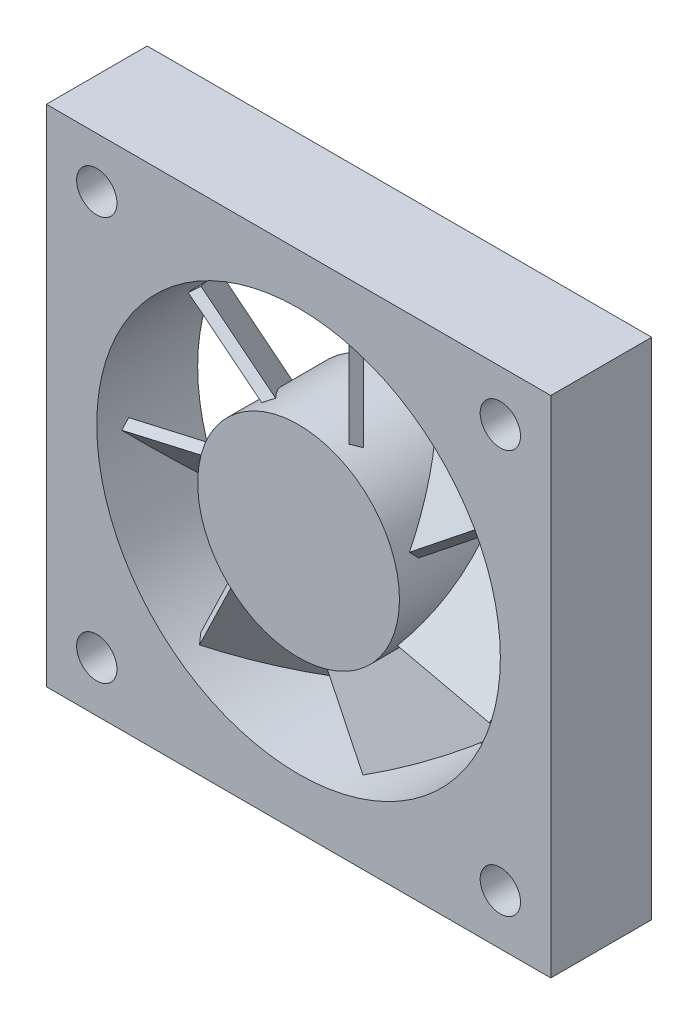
from build123d import *

# Parameters (mm, degrees)
ESQUISSE1_W                  = 50
ESQUISSE1_H                  = 50
ESQUISSE1_R                  = 2
ESQUISSE1_R_2                = 20
BOSS_EXTRU_1_DEPTH           = 10
ESQUISSE1_R_3                = 10
BOSS_EXTRU_1_2_DEPTH         = 10
BOSS_EXTRU_2_REACH           = 38.742
BOSS_EXTRU_2_END_RADIUS      = 19
R_P_TITION_CIRCULAIRE1_COUNT = 7


with BuildPart() as part:
    # Esquisse1 → Boss.-Extru.1 (new body)
    with BuildSketch(Plane.XY):
        Rectangle(ESQUISSE1_W, ESQUISSE1_H)
        with Locations((-20, -20)):
            Circle(ESQUISSE1_R, mode=Mode.SUBTRACT)
        with Locations((20, -20)):
            Circle(ESQUISSE1_R, mode=Mode.SUBTRACT)
        with Locations((20, 20)):
            Circle(ESQUISSE1_R, mode=Mode.SUBTRACT)
        with Locations((-20, 20)):
            Circle(ESQUISSE1_R, mode=Mode.SUBTRACT)
        Circle(ESQUISSE1_R_2, mode=Mode.SUBTRACT)
    extrude(amount=BOSS_EXTRU_1_DEPTH)


with BuildPart() as body_2:
    # Esquisse1 → Boss.-Extru.1 2 (new body)
    with BuildSketch(Plane.XY):
        Circle(ESQUISSE1_R_3)
    extrude(amount=BOSS_EXTRU_1_2_DEPTH)

    # Boss.-Extru.2: up to this cylinder (the profile starts inside it)
    boss_extru_2_end = Plane(origin=(0, 0, 4.646447), z_dir=(0, 0, -1)) * Cylinder(BOSS_EXTRU_2_END_RADIUS, 116.484, mode=Mode.PRIVATE)
    # Esquisse2 → Boss.-Extru.2 (add, up to the surface)
    with BuildSketch(Plane(origin=(0, 0, 0), x_dir=(1, 0, 0), z_dir=(0, 1, 0)), mode=Mode.PRIVATE) as boss_extru_2_sk1:
        Polygon((-3.535533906, -1.464466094), (3.535533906, -8.535533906), (4.242640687, -7.828427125), (-2.828427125, -0.757359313), align=None)
    boss_extru_2_tool1 = extrude(boss_extru_2_sk1.sketch, amount=BOSS_EXTRU_2_REACH, mode=Mode.PRIVATE) & boss_extru_2_end
    boss_extru_2 = boss_extru_2_tool1.solids().sort_by_distance((0.353553, 0, 4.646447))[0]
    add(boss_extru_2)

    # R_p_tition circulaire1: Boss.-Extru.2 ×7 about axis
    r_p_tition_circulaire1_axis = Axis((0, 0, 0), (0, 0, 1))
    for i in range(1, R_P_TITION_CIRCULAIRE1_COUNT):
        add(boss_extru_2.rotate(r_p_tition_circulaire1_axis, i * 360 / R_P_TITION_CIRCULAIRE1_COUNT))


solid = Compound([part.part, body_2.part])
